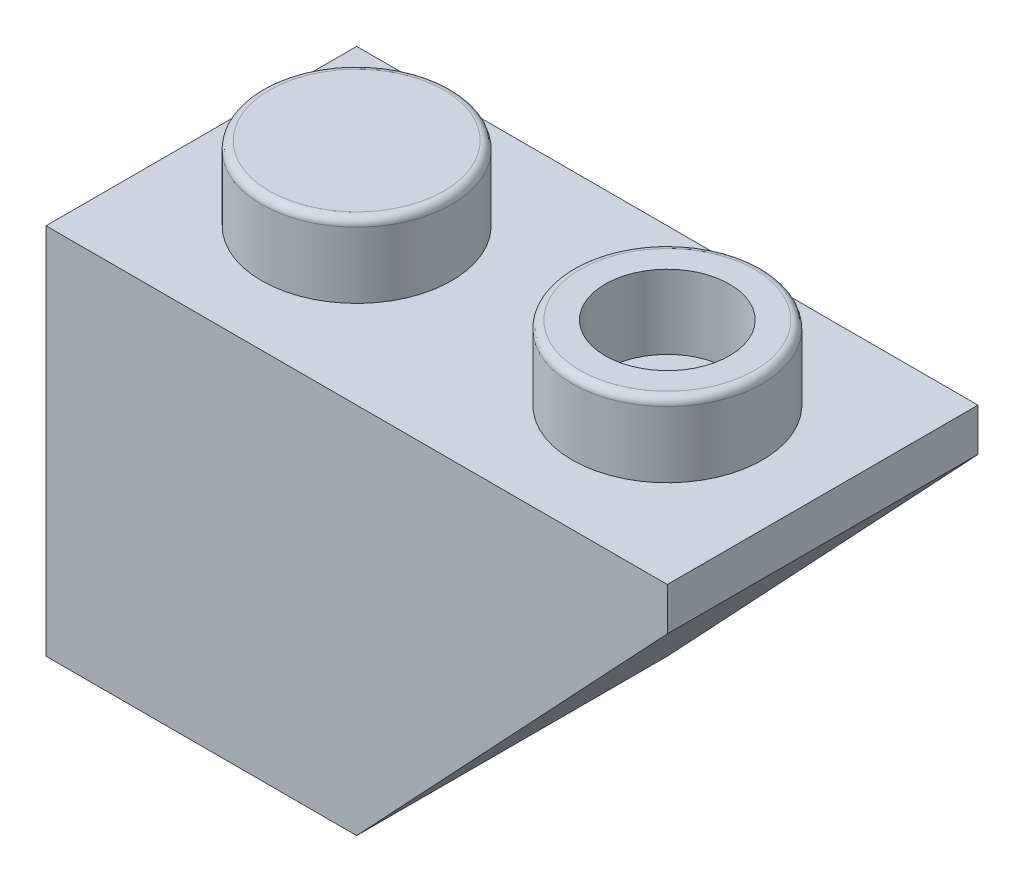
ISO-10303-21;
HEADER;
FILE_DESCRIPTION(('STEP AP214'),'2;1');
FILE_NAME('part.step','',(''),(''),'','','');
FILE_SCHEMA(('AUTOMOTIVE_DESIGN { 1 0 10303 214 1 1 1 1 }'));
ENDSEC;
DATA;
#1=APPLICATION_CONTEXT('core data for automotive mechanical design processes');
#2=APPLICATION_PROTOCOL_DEFINITION('international standard','automotive_design',2000,#1);
#3=PRODUCT_CONTEXT('',#1,'mechanical');
#4=PRODUCT('Part','Part','',(#3));
#5=PRODUCT_RELATED_PRODUCT_CATEGORY('part','',(#4));
#6=PRODUCT_DEFINITION_FORMATION('','',#4);
#7=PRODUCT_DEFINITION_CONTEXT('part definition',#1,'design');
#8=PRODUCT_DEFINITION('design','',#6,#7);
#9=PRODUCT_DEFINITION_SHAPE('','',#8);
#10=(LENGTH_UNIT() NAMED_UNIT(*) SI_UNIT(.MILLI.,.METRE.));
#11=(NAMED_UNIT(*) PLANE_ANGLE_UNIT() SI_UNIT($,.RADIAN.));
#12=(NAMED_UNIT(*) SI_UNIT($,.STERADIAN.) SOLID_ANGLE_UNIT());
#13=UNCERTAINTY_MEASURE_WITH_UNIT(LENGTH_MEASURE(1.E-05),#10,'distance_accuracy_value','');
#14=(GEOMETRIC_REPRESENTATION_CONTEXT(3) GLOBAL_UNCERTAINTY_ASSIGNED_CONTEXT((#13)) GLOBAL_UNIT_ASSIGNED_CONTEXT((#10,
#11,#12)) REPRESENTATION_CONTEXT('',''));
#15=CARTESIAN_POINT('',(0.,0.,0.));
#16=DIRECTION('',(0.,0.,1.));
#17=DIRECTION('',(1.,0.,0.));
#18=AXIS2_PLACEMENT_3D('',#15,#16,#17);
#19=CARTESIAN_POINT('',(7.4,8.6,7.4));
#20=DIRECTION('',(1.,0.,0.));
#21=DIRECTION('',(0.,0.,-1.));
#22=AXIS2_PLACEMENT_3D('',#19,#20,#21);
#23=PLANE('',#22);
#24=DIRECTION('',(0.,1.,0.));
#25=VECTOR('',#24,1.);
#26=CARTESIAN_POINT('',(7.4,0.400000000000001,4.5));
#27=LINE('',#26,#25);
#28=CARTESIAN_POINT('',(7.4,0.400000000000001,4.5));
#29=VERTEX_POINT('',#28);
#30=CARTESIAN_POINT('',(7.4,8.6,4.5));
#31=VERTEX_POINT('',#30);
#32=EDGE_CURVE('E121',#29,#31,#27,.T.);
#33=ORIENTED_EDGE('',*,*,#32,.F.);
#34=DIRECTION('',(0.,0.,1.));
#35=VECTOR('',#34,1.);
#36=CARTESIAN_POINT('',(7.4,0.400000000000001,4.5));
#37=LINE('',#36,#35);
#38=CARTESIAN_POINT('',(7.4,0.400000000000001,3.5));
#39=VERTEX_POINT('',#38);
#40=EDGE_CURVE('E385',#39,#29,#37,.T.);
#41=ORIENTED_EDGE('',*,*,#40,.F.);
#42=DIRECTION('',(0.,1.,0.));
#43=VECTOR('',#42,1.);
#44=CARTESIAN_POINT('',(7.4,0.400000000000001,3.5));
#45=LINE('',#44,#43);
#46=CARTESIAN_POINT('',(7.4,8.6,3.5));
#47=VERTEX_POINT('',#46);
#48=EDGE_CURVE('E383',#39,#47,#45,.T.);
#49=ORIENTED_EDGE('',*,*,#48,.T.);
#50=DIRECTION('',(0.,0.,1.));
#51=VECTOR('',#50,1.);
#52=CARTESIAN_POINT('',(7.4,8.6,7.4));
#53=LINE('',#52,#51);
#54=CARTESIAN_POINT('',(7.4,8.6,0.6));
#55=VERTEX_POINT('',#54);
#56=EDGE_CURVE('E147',#55,#47,#53,.T.);
#57=ORIENTED_EDGE('',*,*,#56,.F.);
#58=DIRECTION('',(0.,-1.,0.));
#59=VECTOR('',#58,1.);
#60=CARTESIAN_POINT('',(7.4,8.6,0.6));
#61=LINE('',#60,#59);
#62=CARTESIAN_POINT('',(7.4,0.,0.6));
#63=VERTEX_POINT('',#62);
#64=EDGE_CURVE('E163',#55,#63,#61,.T.);
#65=ORIENTED_EDGE('',*,*,#64,.T.);
#66=DIRECTION('',(0.,0.,1.));
#67=VECTOR('',#66,1.);
#68=CARTESIAN_POINT('',(7.4,0.,7.4));
#69=LINE('',#68,#67);
#70=CARTESIAN_POINT('',(7.4,0.,7.4));
#71=VERTEX_POINT('',#70);
#72=EDGE_CURVE('E368',#63,#71,#69,.T.);
#73=ORIENTED_EDGE('',*,*,#72,.T.);
#74=DIRECTION('',(0.,-1.,0.));
#75=VECTOR('',#74,1.);
#76=CARTESIAN_POINT('',(7.4,8.6,7.4));
#77=LINE('',#76,#75);
#78=CARTESIAN_POINT('',(7.4,8.6,7.4));
#79=VERTEX_POINT('',#78);
#80=EDGE_CURVE('E145',#79,#71,#77,.T.);
#81=ORIENTED_EDGE('',*,*,#80,.F.);
#82=EDGE_CURVE('E139',#31,#79,#53,.T.);
#83=ORIENTED_EDGE('',*,*,#82,.F.);
#84=EDGE_LOOP('',(#33,#41,#49,#57,#65,#73,#81,#83));
#85=FACE_BOUND('',#84,.T.);
#86=ADVANCED_FACE('F26',(#85),#23,.F.);
#87=CARTESIAN_POINT('',(0.600000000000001,8.6,0.6));
#88=DIRECTION('',(0.,-1.,0.));
#89=DIRECTION('',(0.,0.,-1.));
#90=AXIS2_PLACEMENT_3D('',#87,#88,#89);
#91=PLANE('',#90);
#92=CARTESIAN_POINT('',(4.,8.6,4.));
#93=DIRECTION('',(0.,-1.,0.));
#94=DIRECTION('',(0.,0.,-1.));
#95=AXIS2_PLACEMENT_3D('',#92,#93,#94);
#96=CIRCLE('',#95,1.25);
#97=CARTESIAN_POINT('',(4.,8.6,2.75));
#98=VERTEX_POINT('',#97);
#99=EDGE_CURVE('E374',#98,#98,#96,.T.);
#100=ORIENTED_EDGE('',*,*,#99,.F.);
#101=EDGE_LOOP('',(#100));
#102=FACE_BOUND('',#101,.T.);
#103=DIRECTION('',(0.,0.,-1.));
#104=VECTOR('',#103,1.);
#105=CARTESIAN_POINT('',(6.9,8.6,4.5));
#106=LINE('',#105,#104);
#107=CARTESIAN_POINT('',(6.9,8.6,4.5));
#108=VERTEX_POINT('',#107);
#109=CARTESIAN_POINT('',(6.9,8.6,3.5));
#110=VERTEX_POINT('',#109);
#111=EDGE_CURVE('E142',#108,#110,#106,.T.);
#112=ORIENTED_EDGE('',*,*,#111,.F.);
#113=DIRECTION('',(-1.,0.,0.));
#114=VECTOR('',#113,1.);
#115=CARTESIAN_POINT('',(7.4,8.6,4.5));
#116=LINE('',#115,#114);
#117=EDGE_CURVE('E125',#31,#108,#116,.T.);
#118=ORIENTED_EDGE('',*,*,#117,.F.);
#119=ORIENTED_EDGE('',*,*,#82,.T.);
#120=DIRECTION('',(-1.,0.,0.));
#121=VECTOR('',#120,1.);
#122=CARTESIAN_POINT('',(0.6,8.6,7.4));
#123=LINE('',#122,#121);
#124=CARTESIAN_POINT('',(0.6,8.6,7.4));
#125=VERTEX_POINT('',#124);
#126=EDGE_CURVE('E151',#79,#125,#123,.T.);
#127=ORIENTED_EDGE('',*,*,#126,.T.);
#128=DIRECTION('',(0.,0.,-1.));
#129=VECTOR('',#128,1.);
#130=CARTESIAN_POINT('',(0.6,8.6,7.4));
#131=LINE('',#130,#129);
#132=CARTESIAN_POINT('',(0.600000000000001,8.6,0.6));
#133=VERTEX_POINT('',#132);
#134=EDGE_CURVE('E153',#125,#133,#131,.T.);
#135=ORIENTED_EDGE('',*,*,#134,.T.);
#136=DIRECTION('',(1.,0.,0.));
#137=VECTOR('',#136,1.);
#138=CARTESIAN_POINT('',(0.600000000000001,8.6,0.6));
#139=LINE('',#138,#137);
#140=EDGE_CURVE('E148',#133,#55,#139,.T.);
#141=ORIENTED_EDGE('',*,*,#140,.T.);
#142=ORIENTED_EDGE('',*,*,#56,.T.);
#143=DIRECTION('',(1.,0.,0.));
#144=VECTOR('',#143,1.);
#145=CARTESIAN_POINT('',(7.4,8.6,3.5));
#146=LINE('',#145,#144);
#147=EDGE_CURVE('E384',#110,#47,#146,.T.);
#148=ORIENTED_EDGE('',*,*,#147,.F.);
#149=EDGE_LOOP('',(#112,#118,#119,#127,#135,#141,#142,#148));
#150=FACE_BOUND('',#149,.T.);
#151=ADVANCED_FACE('F137',(#102,#150),#91,.T.);
#152=CARTESIAN_POINT('',(0.,9.6,8.));
#153=DIRECTION('',(0.,-1.,0.));
#154=DIRECTION('',(0.,0.,-1.));
#155=AXIS2_PLACEMENT_3D('',#152,#153,#154);
#156=PLANE('',#155);
#157=CARTESIAN_POINT('',(12.,9.6,4.));
#158=DIRECTION('',(0.,-1.,0.));
#159=DIRECTION('',(0.,0.,-1.));
#160=AXIS2_PLACEMENT_3D('',#157,#158,#159);
#161=CIRCLE('',#160,2.45);
#162=CARTESIAN_POINT('',(12.,9.6,1.55));
#163=VERTEX_POINT('',#162);
#164=EDGE_CURVE('E204',#163,#163,#161,.F.);
#165=ORIENTED_EDGE('',*,*,#164,.F.);
#166=EDGE_LOOP('',(#165));
#167=FACE_BOUND('',#166,.T.);
#168=DIRECTION('',(-1.,0.,0.));
#169=VECTOR('',#168,1.);
#170=CARTESIAN_POINT('',(0.,9.6,0.));
#171=LINE('',#170,#169);
#172=CARTESIAN_POINT('',(16.,9.6,0.));
#173=VERTEX_POINT('',#172);
#174=CARTESIAN_POINT('',(0.,9.6,0.));
#175=VERTEX_POINT('',#174);
#176=EDGE_CURVE('E183',#173,#175,#171,.T.);
#177=ORIENTED_EDGE('',*,*,#176,.T.);
#178=DIRECTION('',(0.,0.,-1.));
#179=VECTOR('',#178,1.);
#180=CARTESIAN_POINT('',(0.,9.6,8.));
#181=LINE('',#180,#179);
#182=CARTESIAN_POINT('',(0.,9.6,8.));
#183=VERTEX_POINT('',#182);
#184=EDGE_CURVE('E195',#183,#175,#181,.T.);
#185=ORIENTED_EDGE('',*,*,#184,.F.);
#186=DIRECTION('',(-1.,0.,0.));
#187=VECTOR('',#186,1.);
#188=CARTESIAN_POINT('',(0.,9.6,8.));
#189=LINE('',#188,#187);
#190=CARTESIAN_POINT('',(16.,9.6,8.));
#191=VERTEX_POINT('',#190);
#192=EDGE_CURVE('E193',#191,#183,#189,.T.);
#193=ORIENTED_EDGE('',*,*,#192,.F.);
#194=DIRECTION('',(0.,0.,-1.));
#195=VECTOR('',#194,1.);
#196=CARTESIAN_POINT('',(16.,9.6,8.));
#197=LINE('',#196,#195);
#198=EDGE_CURVE('E198',#191,#173,#197,.T.);
#199=ORIENTED_EDGE('',*,*,#198,.T.);
#200=EDGE_LOOP('',(#177,#185,#193,#199));
#201=FACE_BOUND('',#200,.T.);
#202=CARTESIAN_POINT('',(4.,9.6,4.));
#203=DIRECTION('',(0.,-1.,0.));
#204=DIRECTION('',(0.,0.,-1.));
#205=AXIS2_PLACEMENT_3D('',#202,#203,#204);
#206=CIRCLE('',#205,2.45);
#207=CARTESIAN_POINT('',(4.,9.6,1.55));
#208=VERTEX_POINT('',#207);
#209=EDGE_CURVE('E207',#208,#208,#206,.F.);
#210=ORIENTED_EDGE('',*,*,#209,.F.);
#211=EDGE_LOOP('',(#210));
#212=FACE_BOUND('',#211,.T.);
#213=ADVANCED_FACE('F243',(#167,#201,#212),#156,.F.);
#214=CARTESIAN_POINT('',(0.,0.,8.));
#215=DIRECTION('',(1.,0.,0.));
#216=DIRECTION('',(0.,1.,0.));
#217=AXIS2_PLACEMENT_3D('',#214,#215,#216);
#218=PLANE('',#217);
#219=DIRECTION('',(0.,-1.,0.));
#220=VECTOR('',#219,1.);
#221=CARTESIAN_POINT('',(0.,0.,0.));
#222=LINE('',#221,#220);
#223=CARTESIAN_POINT('',(0.,0.,0.));
#224=VERTEX_POINT('',#223);
#225=EDGE_CURVE('E174',#175,#224,#222,.T.);
#226=ORIENTED_EDGE('',*,*,#225,.T.);
#227=DIRECTION('',(0.,0.,-1.));
#228=VECTOR('',#227,1.);
#229=CARTESIAN_POINT('',(0.,0.,8.));
#230=LINE('',#229,#228);
#231=CARTESIAN_POINT('',(0.,0.,8.));
#232=VERTEX_POINT('',#231);
#233=EDGE_CURVE('E201',#232,#224,#230,.T.);
#234=ORIENTED_EDGE('',*,*,#233,.F.);
#235=DIRECTION('',(0.,-1.,0.));
#236=VECTOR('',#235,1.);
#237=CARTESIAN_POINT('',(0.,0.,8.));
#238=LINE('',#237,#236);
#239=EDGE_CURVE('E185',#183,#232,#238,.T.);
#240=ORIENTED_EDGE('',*,*,#239,.F.);
#241=ORIENTED_EDGE('',*,*,#184,.T.);
#242=EDGE_LOOP('',(#226,#234,#240,#241));
#243=FACE_BOUND('',#242,.T.);
#244=ADVANCED_FACE('F28',(#243),#218,.F.);
#245=CARTESIAN_POINT('',(0.,0.,8.));
#246=DIRECTION('',(0.,1.,0.));
#247=DIRECTION('',(0.,0.,1.));
#248=AXIS2_PLACEMENT_3D('',#245,#246,#247);
#249=PLANE('',#248);
#250=DIRECTION('',(1.,0.,0.));
#251=VECTOR('',#250,1.);
#252=CARTESIAN_POINT('',(0.600000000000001,0.,0.6));
#253=LINE('',#252,#251);
#254=CARTESIAN_POINT('',(0.600000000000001,0.,0.6));
#255=VERTEX_POINT('',#254);
#256=EDGE_CURVE('E286',#255,#63,#253,.T.);
#257=ORIENTED_EDGE('',*,*,#256,.F.);
#258=DIRECTION('',(0.,0.,-1.));
#259=VECTOR('',#258,1.);
#260=CARTESIAN_POINT('',(0.6,0.,7.4));
#261=LINE('',#260,#259);
#262=CARTESIAN_POINT('',(0.6,0.,7.4));
#263=VERTEX_POINT('',#262);
#264=EDGE_CURVE('E49',#263,#255,#261,.T.);
#265=ORIENTED_EDGE('',*,*,#264,.F.);
#266=DIRECTION('',(-1.,0.,0.));
#267=VECTOR('',#266,1.);
#268=CARTESIAN_POINT('',(0.6,0.,7.4));
#269=LINE('',#268,#267);
#270=EDGE_CURVE('E366',#71,#263,#269,.T.);
#271=ORIENTED_EDGE('',*,*,#270,.F.);
#272=ORIENTED_EDGE('',*,*,#72,.F.);
#273=EDGE_LOOP('',(#257,#265,#271,#272));
#274=FACE_BOUND('',#273,.T.);
#275=DIRECTION('',(1.,0.,0.));
#276=VECTOR('',#275,1.);
#277=CARTESIAN_POINT('',(0.,0.,0.));
#278=LINE('',#277,#276);
#279=CARTESIAN_POINT('',(8.,0.,0.));
#280=VERTEX_POINT('',#279);
#281=EDGE_CURVE('E178',#224,#280,#278,.T.);
#282=ORIENTED_EDGE('',*,*,#281,.T.);
#283=DIRECTION('',(0.,0.,1.));
#284=VECTOR('',#283,1.);
#285=CARTESIAN_POINT('',(8.,0.,0.));
#286=LINE('',#285,#284);
#287=CARTESIAN_POINT('',(8.,0.,8.));
#288=VERTEX_POINT('',#287);
#289=EDGE_CURVE('E171',#280,#288,#286,.T.);
#290=ORIENTED_EDGE('',*,*,#289,.T.);
#291=DIRECTION('',(1.,0.,0.));
#292=VECTOR('',#291,1.);
#293=CARTESIAN_POINT('',(0.,0.,8.));
#294=LINE('',#293,#292);
#295=EDGE_CURVE('E188',#232,#288,#294,.T.);
#296=ORIENTED_EDGE('',*,*,#295,.F.);
#297=ORIENTED_EDGE('',*,*,#233,.T.);
#298=EDGE_LOOP('',(#282,#290,#296,#297));
#299=FACE_BOUND('',#298,.T.);
#300=ADVANCED_FACE('F274',(#274,#299),#249,.F.);
#301=CARTESIAN_POINT('',(16.,0.,8.));
#302=DIRECTION('',(-1.,0.,0.));
#303=DIRECTION('',(0.,-1.,0.));
#304=AXIS2_PLACEMENT_3D('',#301,#302,#303);
#305=PLANE('',#304);
#306=DIRECTION('',(0.,1.,0.));
#307=VECTOR('',#306,1.);
#308=CARTESIAN_POINT('',(16.,0.,8.));
#309=LINE('',#308,#307);
#310=CARTESIAN_POINT('',(16.,8.5,8.));
#311=VERTEX_POINT('',#310);
#312=EDGE_CURVE('E191',#311,#191,#309,.T.);
#313=ORIENTED_EDGE('',*,*,#312,.F.);
#314=DIRECTION('',(0.,0.,1.));
#315=VECTOR('',#314,1.);
#316=CARTESIAN_POINT('',(16.,8.5,0.));
#317=LINE('',#316,#315);
#318=CARTESIAN_POINT('',(16.,8.5,0.));
#319=VERTEX_POINT('',#318);
#320=EDGE_CURVE('E170',#319,#311,#317,.T.);
#321=ORIENTED_EDGE('',*,*,#320,.F.);
#322=DIRECTION('',(0.,1.,0.));
#323=VECTOR('',#322,1.);
#324=CARTESIAN_POINT('',(16.,0.,0.));
#325=LINE('',#324,#323);
#326=EDGE_CURVE('E181',#319,#173,#325,.T.);
#327=ORIENTED_EDGE('',*,*,#326,.T.);
#328=ORIENTED_EDGE('',*,*,#198,.F.);
#329=EDGE_LOOP('',(#313,#321,#327,#328));
#330=FACE_BOUND('',#329,.T.);
#331=ADVANCED_FACE('F268',(#330),#305,.F.);
#332=CARTESIAN_POINT('',(0.,9.6,8.));
#333=DIRECTION('',(0.,0.,-1.));
#334=DIRECTION('',(-1.,0.,0.));
#335=AXIS2_PLACEMENT_3D('',#332,#333,#334);
#336=PLANE('',#335);
#337=ORIENTED_EDGE('',*,*,#295,.T.);
#338=DIRECTION('',(-0.685364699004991,-0.728199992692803,0.));
#339=VECTOR('',#338,1.);
#340=CARTESIAN_POINT('',(16.,8.5,8.));
#341=LINE('',#340,#339);
#342=EDGE_CURVE('E161',#311,#288,#341,.T.);
#343=ORIENTED_EDGE('',*,*,#342,.F.);
#344=ORIENTED_EDGE('',*,*,#312,.T.);
#345=ORIENTED_EDGE('',*,*,#192,.T.);
#346=ORIENTED_EDGE('',*,*,#239,.T.);
#347=EDGE_LOOP('',(#337,#343,#344,#345,#346));
#348=FACE_BOUND('',#347,.T.);
#349=ADVANCED_FACE('F264',(#348),#336,.F.);
#350=CARTESIAN_POINT('',(0.,9.6,0.));
#351=DIRECTION('',(0.,0.,-1.));
#352=DIRECTION('',(-1.,0.,0.));
#353=AXIS2_PLACEMENT_3D('',#350,#351,#352);
#354=PLANE('',#353);
#355=DIRECTION('',(-0.685364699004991,-0.728199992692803,0.));
#356=VECTOR('',#355,1.);
#357=CARTESIAN_POINT('',(16.,8.5,0.));
#358=LINE('',#357,#356);
#359=EDGE_CURVE('E167',#319,#280,#358,.T.);
#360=ORIENTED_EDGE('',*,*,#359,.T.);
#361=ORIENTED_EDGE('',*,*,#281,.F.);
#362=ORIENTED_EDGE('',*,*,#225,.F.);
#363=ORIENTED_EDGE('',*,*,#176,.F.);
#364=ORIENTED_EDGE('',*,*,#326,.F.);
#365=EDGE_LOOP('',(#360,#361,#362,#363,#364));
#366=FACE_BOUND('',#365,.T.);
#367=ADVANCED_FACE('F260',(#366),#354,.T.);
#368=CARTESIAN_POINT('',(16.,8.5,0.));
#369=DIRECTION('',(-0.728199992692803,0.685364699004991,0.));
#370=DIRECTION('',(-0.685364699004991,-0.728199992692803,0.));
#371=AXIS2_PLACEMENT_3D('',#368,#369,#370);
#372=PLANE('',#371);
#373=ORIENTED_EDGE('',*,*,#342,.T.);
#374=ORIENTED_EDGE('',*,*,#289,.F.);
#375=ORIENTED_EDGE('',*,*,#359,.F.);
#376=ORIENTED_EDGE('',*,*,#320,.T.);
#377=EDGE_LOOP('',(#373,#374,#375,#376));
#378=FACE_BOUND('',#377,.T.);
#379=ADVANCED_FACE('F257',(#378),#372,.F.);
#380=CARTESIAN_POINT('',(0.6,8.6,7.4));
#381=DIRECTION('',(-1.,0.,0.));
#382=DIRECTION('',(0.,0.,1.));
#383=AXIS2_PLACEMENT_3D('',#380,#381,#382);
#384=PLANE('',#383);
#385=ORIENTED_EDGE('',*,*,#264,.T.);
#386=DIRECTION('',(0.,-1.,0.));
#387=VECTOR('',#386,1.);
#388=CARTESIAN_POINT('',(0.600000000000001,8.6,0.6));
#389=LINE('',#388,#387);
#390=EDGE_CURVE('E158',#133,#255,#389,.T.);
#391=ORIENTED_EDGE('',*,*,#390,.F.);
#392=ORIENTED_EDGE('',*,*,#134,.F.);
#393=DIRECTION('',(0.,-1.,0.));
#394=VECTOR('',#393,1.);
#395=CARTESIAN_POINT('',(0.6,8.6,7.4));
#396=LINE('',#395,#394);
#397=EDGE_CURVE('E159',#125,#263,#396,.T.);
#398=ORIENTED_EDGE('',*,*,#397,.T.);
#399=EDGE_LOOP('',(#385,#391,#392,#398));
#400=FACE_BOUND('',#399,.T.);
#401=ADVANCED_FACE('F254',(#400),#384,.F.);
#402=CARTESIAN_POINT('',(0.6,8.6,7.4));
#403=DIRECTION('',(0.,0.,1.));
#404=DIRECTION('',(1.,0.,0.));
#405=AXIS2_PLACEMENT_3D('',#402,#403,#404);
#406=PLANE('',#405);
#407=ORIENTED_EDGE('',*,*,#270,.T.);
#408=ORIENTED_EDGE('',*,*,#397,.F.);
#409=ORIENTED_EDGE('',*,*,#126,.F.);
#410=ORIENTED_EDGE('',*,*,#80,.T.);
#411=EDGE_LOOP('',(#407,#408,#409,#410));
#412=FACE_BOUND('',#411,.T.);
#413=ADVANCED_FACE('F248',(#412),#406,.F.);
#414=CARTESIAN_POINT('',(0.600000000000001,8.6,0.6));
#415=DIRECTION('',(0.,0.,-1.));
#416=DIRECTION('',(-1.,0.,0.));
#417=AXIS2_PLACEMENT_3D('',#414,#415,#416);
#418=PLANE('',#417);
#419=ORIENTED_EDGE('',*,*,#256,.T.);
#420=ORIENTED_EDGE('',*,*,#64,.F.);
#421=ORIENTED_EDGE('',*,*,#140,.F.);
#422=ORIENTED_EDGE('',*,*,#390,.T.);
#423=EDGE_LOOP('',(#419,#420,#421,#422));
#424=FACE_BOUND('',#423,.T.);
#425=ADVANCED_FACE('F249',(#424),#418,.F.);
#426=CARTESIAN_POINT('',(12.,11.5,4.));
#427=DIRECTION('',(0.,-1.,0.));
#428=DIRECTION('',(0.,0.,-1.));
#429=AXIS2_PLACEMENT_3D('',#426,#427,#428);
#430=CYLINDRICAL_SURFACE('',#429,2.45);
#431=CARTESIAN_POINT('',(12.,11.3,4.));
#432=DIRECTION('',(0.,1.,0.));
#433=DIRECTION('',(0.,0.,1.));
#434=AXIS2_PLACEMENT_3D('',#431,#432,#433);
#435=CIRCLE('',#434,2.45);
#436=CARTESIAN_POINT('',(12.,11.3,1.55));
#437=VERTEX_POINT('',#436);
#438=EDGE_CURVE('E11',#437,#437,#435,.F.);
#439=CARTESIAN_POINT('',(12.,11.3,1.55));
#440=CARTESIAN_POINT('',(12.,11.2822916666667,1.55));
#441=CARTESIAN_POINT('',(12.,11.2645833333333,1.55));
#442=CARTESIAN_POINT('',(12.,11.2291666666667,1.55));
#443=CARTESIAN_POINT('',(12.,11.2114583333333,1.55));
#444=CARTESIAN_POINT('',(12.,11.1760416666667,1.55));
#445=CARTESIAN_POINT('',(12.,11.1583333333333,1.55));
#446=CARTESIAN_POINT('',(12.,11.1229166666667,1.55));
#447=CARTESIAN_POINT('',(12.,11.1052083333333,1.55));
#448=CARTESIAN_POINT('',(12.,11.0697916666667,1.55));
#449=CARTESIAN_POINT('',(12.,11.0520833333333,1.55));
#450=CARTESIAN_POINT('',(12.,11.0166666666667,1.55));
#451=CARTESIAN_POINT('',(12.,10.9989583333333,1.55));
#452=CARTESIAN_POINT('',(12.,10.9635416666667,1.55));
#453=CARTESIAN_POINT('',(12.,10.9458333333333,1.55));
#454=CARTESIAN_POINT('',(12.,10.9104166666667,1.55));
#455=CARTESIAN_POINT('',(12.,10.8927083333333,1.55));
#456=CARTESIAN_POINT('',(12.,10.8572916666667,1.55));
#457=CARTESIAN_POINT('',(12.,10.8395833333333,1.55));
#458=CARTESIAN_POINT('',(12.,10.8041666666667,1.55));
#459=CARTESIAN_POINT('',(12.,10.7864583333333,1.55));
#460=CARTESIAN_POINT('',(12.,10.7510416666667,1.55));
#461=CARTESIAN_POINT('',(12.,10.7333333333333,1.55));
#462=CARTESIAN_POINT('',(12.,10.6979166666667,1.55));
#463=CARTESIAN_POINT('',(12.,10.6802083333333,1.55));
#464=CARTESIAN_POINT('',(12.,10.6447916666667,1.55));
#465=CARTESIAN_POINT('',(12.,10.6270833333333,1.55));
#466=CARTESIAN_POINT('',(12.,10.5916666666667,1.55));
#467=CARTESIAN_POINT('',(12.,10.5739583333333,1.55));
#468=CARTESIAN_POINT('',(12.,10.5385416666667,1.55));
#469=CARTESIAN_POINT('',(12.,10.5208333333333,1.55));
#470=CARTESIAN_POINT('',(12.,10.4854166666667,1.55));
#471=CARTESIAN_POINT('',(12.,10.4677083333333,1.55));
#472=CARTESIAN_POINT('',(12.,10.4322916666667,1.55));
#473=CARTESIAN_POINT('',(12.,10.4145833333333,1.55));
#474=CARTESIAN_POINT('',(12.,10.3791666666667,1.55));
#475=CARTESIAN_POINT('',(12.,10.3614583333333,1.55));
#476=CARTESIAN_POINT('',(12.,10.3260416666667,1.55));
#477=CARTESIAN_POINT('',(12.,10.3083333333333,1.55));
#478=CARTESIAN_POINT('',(12.,10.2729166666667,1.55));
#479=CARTESIAN_POINT('',(12.,10.2552083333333,1.55));
#480=CARTESIAN_POINT('',(12.,10.2197916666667,1.55));
#481=CARTESIAN_POINT('',(12.,10.2020833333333,1.55));
#482=CARTESIAN_POINT('',(12.,10.1666666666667,1.55));
#483=CARTESIAN_POINT('',(12.,10.1489583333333,1.55));
#484=CARTESIAN_POINT('',(12.,10.1135416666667,1.55));
#485=CARTESIAN_POINT('',(12.,10.0958333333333,1.55));
#486=CARTESIAN_POINT('',(12.,10.0604166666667,1.55));
#487=CARTESIAN_POINT('',(12.,10.0427083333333,1.55));
#488=CARTESIAN_POINT('',(12.,10.0072916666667,1.55));
#489=CARTESIAN_POINT('',(12.,9.98958333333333,1.55));
#490=CARTESIAN_POINT('',(12.,9.95416666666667,1.55));
#491=CARTESIAN_POINT('',(12.,9.93645833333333,1.55));
#492=CARTESIAN_POINT('',(12.,9.90104166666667,1.55));
#493=CARTESIAN_POINT('',(12.,9.88333333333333,1.55));
#494=CARTESIAN_POINT('',(12.,9.84791666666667,1.55));
#495=CARTESIAN_POINT('',(12.,9.83020833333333,1.55));
#496=CARTESIAN_POINT('',(12.,9.79479166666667,1.55));
#497=CARTESIAN_POINT('',(12.,9.77708333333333,1.55));
#498=CARTESIAN_POINT('',(12.,9.74166666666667,1.55));
#499=CARTESIAN_POINT('',(12.,9.72395833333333,1.55));
#500=CARTESIAN_POINT('',(12.,9.68854166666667,1.55));
#501=CARTESIAN_POINT('',(12.,9.67083333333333,1.55));
#502=CARTESIAN_POINT('',(12.,9.63541666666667,1.55));
#503=CARTESIAN_POINT('',(12.,9.61770833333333,1.55));
#504=CARTESIAN_POINT('',(12.,9.6,1.55));
#505=B_SPLINE_CURVE_WITH_KNOTS('',3,(#439,#440,#441,#442,#443,#444,#445,#446,#447,#448,#449,
#450,#451,#452,#453,#454,#455,#456,#457,#458,#459,#460,#461,#462,#463,#464,#465,#466,#467,#468,
#469,#470,#471,#472,#473,#474,#475,#476,#477,#478,#479,#480,#481,#482,#483,#484,#485,#486,#487,
#488,#489,#490,#491,#492,#493,#494,#495,#496,#497,#498,#499,#500,#501,#502,#503,#504),
.UNSPECIFIED.,.F.,.F.,(4,2,2,2,2,2,2,2,2,2,2,2,2,2,2,2,2,2,2,2,2,2,2,2,2,2,2,2,2,2,2,2,4),(0.,
0.0531250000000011,0.10625,0.159375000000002,0.212500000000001,0.265625,0.318750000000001,
0.371875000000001,0.425,0.478125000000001,0.53125,0.584375,0.637500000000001,0.690625,0.74375,
0.796875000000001,0.85,0.903124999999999,0.95625,1.009375,1.0625,1.115625,1.16875,1.221875,
1.275,1.328125,1.38125,1.434375,1.4875,1.540625,1.59375,1.646875,1.7),.UNSPECIFIED.);
#506=EDGE_CURVE('BSEAM252',#437,#163,#505,.T.);
#507=ORIENTED_EDGE('',*,*,#438,.T.);
#508=ORIENTED_EDGE('',*,*,#164,.T.);
#509=ORIENTED_EDGE('',*,*,#506,.T.);
#510=ORIENTED_EDGE('',*,*,#506,.F.);
#511=EDGE_LOOP('',(#507,#509,#508,#510));
#512=FACE_BOUND('',#511,.T.);
#513=ADVANCED_FACE('F252',(#512),#430,.T.);
#514=CARTESIAN_POINT('',(12.,11.5,4.));
#515=DIRECTION('',(0.,1.,0.));
#516=DIRECTION('',(0.,0.,1.));
#517=AXIS2_PLACEMENT_3D('',#514,#515,#516);
#518=PLANE('',#517);
#519=CARTESIAN_POINT('',(12.,11.5,4.));
#520=DIRECTION('',(0.,1.,0.));
#521=DIRECTION('',(0.,0.,1.));
#522=AXIS2_PLACEMENT_3D('',#519,#520,#521);
#523=CIRCLE('',#522,1.6);
#524=CARTESIAN_POINT('',(12.,11.5,5.6));
#525=VERTEX_POINT('',#524);
#526=EDGE_CURVE('E132',#525,#525,#523,.T.);
#527=ORIENTED_EDGE('',*,*,#526,.F.);
#528=EDGE_LOOP('',(#527));
#529=FACE_BOUND('',#528,.T.);
#530=CARTESIAN_POINT('',(12.,11.5,4.));
#531=DIRECTION('',(0.,1.,0.));
#532=DIRECTION('',(0.,0.,1.));
#533=AXIS2_PLACEMENT_3D('',#530,#531,#532);
#534=CIRCLE('',#533,2.25);
#535=CARTESIAN_POINT('',(12.,11.5,6.25));
#536=VERTEX_POINT('',#535);
#537=EDGE_CURVE('E34',#536,#536,#534,.T.);
#538=ORIENTED_EDGE('',*,*,#537,.T.);
#539=EDGE_LOOP('',(#538));
#540=FACE_BOUND('',#539,.T.);
#541=ADVANCED_FACE('F218',(#529,#540),#518,.T.);
#542=CARTESIAN_POINT('',(4.,11.5,4.));
#543=DIRECTION('',(0.,-1.,0.));
#544=DIRECTION('',(0.,0.,-1.));
#545=AXIS2_PLACEMENT_3D('',#542,#543,#544);
#546=CYLINDRICAL_SURFACE('',#545,2.45);
#547=CARTESIAN_POINT('',(4.,11.3,4.));
#548=DIRECTION('',(0.,1.,0.));
#549=DIRECTION('',(0.,0.,1.));
#550=AXIS2_PLACEMENT_3D('',#547,#548,#549);
#551=CIRCLE('',#550,2.45);
#552=CARTESIAN_POINT('',(4.,11.3,1.55));
#553=VERTEX_POINT('',#552);
#554=EDGE_CURVE('E213',#553,#553,#551,.F.);
#555=CARTESIAN_POINT('',(4.,11.3,1.55));
#556=CARTESIAN_POINT('',(4.,11.2822916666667,1.55));
#557=CARTESIAN_POINT('',(4.,11.2645833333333,1.55));
#558=CARTESIAN_POINT('',(4.,11.2291666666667,1.55));
#559=CARTESIAN_POINT('',(4.,11.2114583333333,1.55));
#560=CARTESIAN_POINT('',(4.,11.1760416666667,1.55));
#561=CARTESIAN_POINT('',(4.,11.1583333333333,1.55));
#562=CARTESIAN_POINT('',(4.,11.1229166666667,1.55));
#563=CARTESIAN_POINT('',(4.,11.1052083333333,1.55));
#564=CARTESIAN_POINT('',(4.,11.0697916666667,1.55));
#565=CARTESIAN_POINT('',(4.,11.0520833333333,1.55));
#566=CARTESIAN_POINT('',(4.,11.0166666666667,1.55));
#567=CARTESIAN_POINT('',(4.,10.9989583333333,1.55));
#568=CARTESIAN_POINT('',(4.,10.9635416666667,1.55));
#569=CARTESIAN_POINT('',(4.,10.9458333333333,1.55));
#570=CARTESIAN_POINT('',(4.,10.9104166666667,1.55));
#571=CARTESIAN_POINT('',(4.,10.8927083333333,1.55));
#572=CARTESIAN_POINT('',(4.,10.8572916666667,1.55));
#573=CARTESIAN_POINT('',(4.,10.8395833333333,1.55));
#574=CARTESIAN_POINT('',(4.,10.8041666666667,1.55));
#575=CARTESIAN_POINT('',(4.,10.7864583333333,1.55));
#576=CARTESIAN_POINT('',(4.,10.7510416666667,1.55));
#577=CARTESIAN_POINT('',(4.,10.7333333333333,1.55));
#578=CARTESIAN_POINT('',(4.,10.6979166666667,1.55));
#579=CARTESIAN_POINT('',(4.,10.6802083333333,1.55));
#580=CARTESIAN_POINT('',(4.,10.6447916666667,1.55));
#581=CARTESIAN_POINT('',(4.,10.6270833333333,1.55));
#582=CARTESIAN_POINT('',(4.,10.5916666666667,1.55));
#583=CARTESIAN_POINT('',(4.,10.5739583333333,1.55));
#584=CARTESIAN_POINT('',(4.,10.5385416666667,1.55));
#585=CARTESIAN_POINT('',(4.,10.5208333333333,1.55));
#586=CARTESIAN_POINT('',(4.,10.4854166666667,1.55));
#587=CARTESIAN_POINT('',(4.,10.4677083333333,1.55));
#588=CARTESIAN_POINT('',(4.,10.4322916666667,1.55));
#589=CARTESIAN_POINT('',(4.,10.4145833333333,1.55));
#590=CARTESIAN_POINT('',(4.,10.3791666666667,1.55));
#591=CARTESIAN_POINT('',(4.,10.3614583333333,1.55));
#592=CARTESIAN_POINT('',(4.,10.3260416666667,1.55));
#593=CARTESIAN_POINT('',(4.,10.3083333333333,1.55));
#594=CARTESIAN_POINT('',(4.,10.2729166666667,1.55));
#595=CARTESIAN_POINT('',(4.,10.2552083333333,1.55));
#596=CARTESIAN_POINT('',(4.,10.2197916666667,1.55));
#597=CARTESIAN_POINT('',(4.,10.2020833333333,1.55));
#598=CARTESIAN_POINT('',(4.,10.1666666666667,1.55));
#599=CARTESIAN_POINT('',(4.,10.1489583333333,1.55));
#600=CARTESIAN_POINT('',(4.,10.1135416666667,1.55));
#601=CARTESIAN_POINT('',(4.,10.0958333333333,1.55));
#602=CARTESIAN_POINT('',(4.,10.0604166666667,1.55));
#603=CARTESIAN_POINT('',(4.,10.0427083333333,1.55));
#604=CARTESIAN_POINT('',(4.,10.0072916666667,1.55));
#605=CARTESIAN_POINT('',(4.,9.98958333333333,1.55));
#606=CARTESIAN_POINT('',(4.,9.95416666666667,1.55));
#607=CARTESIAN_POINT('',(4.,9.93645833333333,1.55));
#608=CARTESIAN_POINT('',(4.,9.90104166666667,1.55));
#609=CARTESIAN_POINT('',(4.,9.88333333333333,1.55));
#610=CARTESIAN_POINT('',(4.,9.84791666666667,1.55));
#611=CARTESIAN_POINT('',(4.,9.83020833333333,1.55));
#612=CARTESIAN_POINT('',(4.,9.79479166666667,1.55));
#613=CARTESIAN_POINT('',(4.,9.77708333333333,1.55));
#614=CARTESIAN_POINT('',(4.,9.74166666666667,1.55));
#615=CARTESIAN_POINT('',(4.,9.72395833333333,1.55));
#616=CARTESIAN_POINT('',(4.,9.68854166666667,1.55));
#617=CARTESIAN_POINT('',(4.,9.67083333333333,1.55));
#618=CARTESIAN_POINT('',(4.,9.63541666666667,1.55));
#619=CARTESIAN_POINT('',(4.,9.61770833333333,1.55));
#620=CARTESIAN_POINT('',(4.,9.6,1.55));
#621=B_SPLINE_CURVE_WITH_KNOTS('',3,(#555,#556,#557,#558,#559,#560,#561,#562,#563,#564,#565,
#566,#567,#568,#569,#570,#571,#572,#573,#574,#575,#576,#577,#578,#579,#580,#581,#582,#583,#584,
#585,#586,#587,#588,#589,#590,#591,#592,#593,#594,#595,#596,#597,#598,#599,#600,#601,#602,#603,
#604,#605,#606,#607,#608,#609,#610,#611,#612,#613,#614,#615,#616,#617,#618,#619,#620),
.UNSPECIFIED.,.F.,.F.,(4,2,2,2,2,2,2,2,2,2,2,2,2,2,2,2,2,2,2,2,2,2,2,2,2,2,2,2,2,2,2,2,4),(0.,
0.0531250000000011,0.10625,0.159375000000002,0.212500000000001,0.265625,0.318750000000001,
0.371875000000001,0.425,0.478125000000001,0.53125,0.584375,0.637500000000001,0.690625,0.74375,
0.796875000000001,0.85,0.903124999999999,0.95625,1.009375,1.0625,1.115625,1.16875,1.221875,
1.275,1.328125,1.38125,1.434375,1.4875,1.540625,1.59375,1.646875,1.7),.UNSPECIFIED.);
#622=EDGE_CURVE('BSEAM302',#553,#208,#621,.T.);
#623=ORIENTED_EDGE('',*,*,#554,.T.);
#624=ORIENTED_EDGE('',*,*,#209,.T.);
#625=ORIENTED_EDGE('',*,*,#622,.T.);
#626=ORIENTED_EDGE('',*,*,#622,.F.);
#627=EDGE_LOOP('',(#623,#625,#624,#626));
#628=FACE_BOUND('',#627,.T.);
#629=ADVANCED_FACE('F302',(#628),#546,.T.);
#630=CARTESIAN_POINT('',(4.,11.5,4.));
#631=DIRECTION('',(0.,1.,0.));
#632=DIRECTION('',(0.,0.,1.));
#633=AXIS2_PLACEMENT_3D('',#630,#631,#632);
#634=PLANE('',#633);
#635=CARTESIAN_POINT('',(4.,11.5,4.));
#636=DIRECTION('',(0.,1.,0.));
#637=DIRECTION('',(0.,0.,1.));
#638=AXIS2_PLACEMENT_3D('',#635,#636,#637);
#639=CIRCLE('',#638,2.25);
#640=CARTESIAN_POINT('',(4.,11.5,6.25));
#641=VERTEX_POINT('',#640);
#642=EDGE_CURVE('E210',#641,#641,#639,.T.);
#643=ORIENTED_EDGE('',*,*,#642,.T.);
#644=EDGE_LOOP('',(#643));
#645=FACE_BOUND('',#644,.T.);
#646=ADVANCED_FACE('F233',(#645),#634,.T.);
#647=CARTESIAN_POINT('',(4.,11.3,4.));
#648=DIRECTION('',(0.,1.,0.));
#649=DIRECTION('',(0.,0.,1.));
#650=AXIS2_PLACEMENT_3D('',#647,#648,#649);
#651=TOROIDAL_SURFACE('',#650,2.25,0.2);
#652=ORIENTED_EDGE('',*,*,#554,.F.);
#653=EDGE_LOOP('',(#652));
#654=FACE_BOUND('',#653,.T.);
#655=ORIENTED_EDGE('',*,*,#642,.F.);
#656=EDGE_LOOP('',(#655));
#657=FACE_BOUND('',#656,.T.);
#658=ADVANCED_FACE('F223',(#654,#657),#651,.T.);
#659=CARTESIAN_POINT('',(12.,11.3,4.));
#660=DIRECTION('',(0.,1.,0.));
#661=DIRECTION('',(0.,0.,1.));
#662=AXIS2_PLACEMENT_3D('',#659,#660,#661);
#663=TOROIDAL_SURFACE('',#662,2.25,0.2);
#664=ORIENTED_EDGE('',*,*,#438,.F.);
#665=EDGE_LOOP('',(#664));
#666=FACE_BOUND('',#665,.T.);
#667=ORIENTED_EDGE('',*,*,#537,.F.);
#668=EDGE_LOOP('',(#667));
#669=FACE_BOUND('',#668,.T.);
#670=ADVANCED_FACE('F220',(#666,#669),#663,.T.);
#671=CARTESIAN_POINT('',(4.,10.4,4.));
#672=DIRECTION('',(0.,-1.,0.));
#673=DIRECTION('',(0.,0.,-1.));
#674=AXIS2_PLACEMENT_3D('',#671,#672,#673);
#675=CYLINDRICAL_SURFACE('',#674,1.25);
#676=CARTESIAN_POINT('',(4.,10.4,4.));
#677=DIRECTION('',(0.,-1.,0.));
#678=DIRECTION('',(0.,0.,-1.));
#679=AXIS2_PLACEMENT_3D('',#676,#677,#678);
#680=CIRCLE('',#679,1.25);
#681=CARTESIAN_POINT('',(4.,10.4,2.75));
#682=VERTEX_POINT('',#681);
#683=EDGE_CURVE('E370',#682,#682,#680,.T.);
#684=ORIENTED_EDGE('',*,*,#683,.F.);
#685=EDGE_LOOP('',(#684));
#686=FACE_BOUND('',#685,.T.);
#687=ORIENTED_EDGE('',*,*,#99,.T.);
#688=EDGE_LOOP('',(#687));
#689=FACE_BOUND('',#688,.T.);
#690=ADVANCED_FACE('F222',(#686,#689),#675,.F.);
#691=CARTESIAN_POINT('',(4.,10.4,4.));
#692=DIRECTION('',(0.,-1.,0.));
#693=DIRECTION('',(0.,0.,-1.));
#694=AXIS2_PLACEMENT_3D('',#691,#692,#693);
#695=PLANE('',#694);
#696=ORIENTED_EDGE('',*,*,#683,.T.);
#697=EDGE_LOOP('',(#696));
#698=FACE_BOUND('',#697,.T.);
#699=ADVANCED_FACE('F230',(#698),#695,.T.);
#700=CARTESIAN_POINT('',(12.,9.6,4.));
#701=DIRECTION('',(0.,1.,0.));
#702=DIRECTION('',(0.,0.,1.));
#703=AXIS2_PLACEMENT_3D('',#700,#701,#702);
#704=CYLINDRICAL_SURFACE('',#703,1.6);
#705=CARTESIAN_POINT('',(12.,9.6,4.));
#706=DIRECTION('',(0.,1.,0.));
#707=DIRECTION('',(0.,0.,1.));
#708=AXIS2_PLACEMENT_3D('',#705,#706,#707);
#709=CIRCLE('',#708,1.6);
#710=CARTESIAN_POINT('',(12.,9.6,5.6));
#711=VERTEX_POINT('',#710);
#712=EDGE_CURVE('E400',#711,#711,#709,.T.);
#713=CARTESIAN_POINT('',(12.,9.6,5.6));
#714=CARTESIAN_POINT('',(12.,9.61979166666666,5.6));
#715=CARTESIAN_POINT('',(12.,9.63958333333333,5.6));
#716=CARTESIAN_POINT('',(12.,9.67916666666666,5.6));
#717=CARTESIAN_POINT('',(12.,9.69895833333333,5.6));
#718=CARTESIAN_POINT('',(12.,9.73854166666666,5.6));
#719=CARTESIAN_POINT('',(12.,9.75833333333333,5.6));
#720=CARTESIAN_POINT('',(12.,9.79791666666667,5.6));
#721=CARTESIAN_POINT('',(12.,9.81770833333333,5.6));
#722=CARTESIAN_POINT('',(12.,9.85729166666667,5.6));
#723=CARTESIAN_POINT('',(12.,9.87708333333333,5.6));
#724=CARTESIAN_POINT('',(12.,9.91666666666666,5.6));
#725=CARTESIAN_POINT('',(12.,9.93645833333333,5.6));
#726=CARTESIAN_POINT('',(12.,9.97604166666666,5.6));
#727=CARTESIAN_POINT('',(12.,9.99583333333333,5.6));
#728=CARTESIAN_POINT('',(12.,10.0354166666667,5.6));
#729=CARTESIAN_POINT('',(12.,10.0552083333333,5.6));
#730=CARTESIAN_POINT('',(12.,10.0947916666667,5.6));
#731=CARTESIAN_POINT('',(12.,10.1145833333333,5.6));
#732=CARTESIAN_POINT('',(12.,10.1541666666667,5.6));
#733=CARTESIAN_POINT('',(12.,10.1739583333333,5.6));
#734=CARTESIAN_POINT('',(12.,10.2135416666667,5.6));
#735=CARTESIAN_POINT('',(12.,10.2333333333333,5.6));
#736=CARTESIAN_POINT('',(12.,10.2729166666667,5.6));
#737=CARTESIAN_POINT('',(12.,10.2927083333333,5.6));
#738=CARTESIAN_POINT('',(12.,10.3322916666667,5.6));
#739=CARTESIAN_POINT('',(12.,10.3520833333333,5.6));
#740=CARTESIAN_POINT('',(12.,10.3916666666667,5.6));
#741=CARTESIAN_POINT('',(12.,10.4114583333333,5.6));
#742=CARTESIAN_POINT('',(12.,10.4510416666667,5.6));
#743=CARTESIAN_POINT('',(12.,10.4708333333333,5.6));
#744=CARTESIAN_POINT('',(12.,10.5104166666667,5.6));
#745=CARTESIAN_POINT('',(12.,10.5302083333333,5.6));
#746=CARTESIAN_POINT('',(12.,10.5697916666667,5.6));
#747=CARTESIAN_POINT('',(12.,10.5895833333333,5.6));
#748=CARTESIAN_POINT('',(12.,10.6291666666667,5.6));
#749=CARTESIAN_POINT('',(12.,10.6489583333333,5.6));
#750=CARTESIAN_POINT('',(12.,10.6885416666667,5.6));
#751=CARTESIAN_POINT('',(12.,10.7083333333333,5.6));
#752=CARTESIAN_POINT('',(12.,10.7479166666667,5.6));
#753=CARTESIAN_POINT('',(12.,10.7677083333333,5.6));
#754=CARTESIAN_POINT('',(12.,10.8072916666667,5.6));
#755=CARTESIAN_POINT('',(12.,10.8270833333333,5.6));
#756=CARTESIAN_POINT('',(12.,10.8666666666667,5.6));
#757=CARTESIAN_POINT('',(12.,10.8864583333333,5.6));
#758=CARTESIAN_POINT('',(12.,10.9260416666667,5.6));
#759=CARTESIAN_POINT('',(12.,10.9458333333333,5.6));
#760=CARTESIAN_POINT('',(12.,10.9854166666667,5.6));
#761=CARTESIAN_POINT('',(12.,11.0052083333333,5.6));
#762=CARTESIAN_POINT('',(12.,11.0447916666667,5.6));
#763=CARTESIAN_POINT('',(12.,11.0645833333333,5.6));
#764=CARTESIAN_POINT('',(12.,11.1041666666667,5.6));
#765=CARTESIAN_POINT('',(12.,11.1239583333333,5.6));
#766=CARTESIAN_POINT('',(12.,11.1635416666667,5.6));
#767=CARTESIAN_POINT('',(12.,11.1833333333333,5.6));
#768=CARTESIAN_POINT('',(12.,11.2229166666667,5.6));
#769=CARTESIAN_POINT('',(12.,11.2427083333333,5.6));
#770=CARTESIAN_POINT('',(12.,11.2822916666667,5.6));
#771=CARTESIAN_POINT('',(12.,11.3020833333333,5.6));
#772=CARTESIAN_POINT('',(12.,11.3416666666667,5.6));
#773=CARTESIAN_POINT('',(12.,11.3614583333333,5.6));
#774=CARTESIAN_POINT('',(12.,11.4010416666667,5.6));
#775=CARTESIAN_POINT('',(12.,11.4208333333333,5.6));
#776=CARTESIAN_POINT('',(12.,11.4604166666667,5.6));
#777=CARTESIAN_POINT('',(12.,11.4802083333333,5.6));
#778=CARTESIAN_POINT('',(12.,11.5,5.6));
#779=B_SPLINE_CURVE_WITH_KNOTS('',3,(#713,#714,#715,#716,#717,#718,#719,#720,#721,#722,#723,
#724,#725,#726,#727,#728,#729,#730,#731,#732,#733,#734,#735,#736,#737,#738,#739,#740,#741,#742,
#743,#744,#745,#746,#747,#748,#749,#750,#751,#752,#753,#754,#755,#756,#757,#758,#759,#760,#761,
#762,#763,#764,#765,#766,#767,#768,#769,#770,#771,#772,#773,#774,#775,#776,#777,#778),
.UNSPECIFIED.,.F.,.F.,(4,2,2,2,2,2,2,2,2,2,2,2,2,2,2,2,2,2,2,2,2,2,2,2,2,2,2,2,2,2,2,2,4),(0.,
0.0593750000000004,0.118750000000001,0.178125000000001,0.237500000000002,0.296875,
0.356250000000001,0.415625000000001,0.475000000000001,0.534375,0.593750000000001,
0.653125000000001,0.712500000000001,0.771875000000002,0.83125,0.890625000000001,
0.950000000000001,1.009375,1.06875,1.128125,1.1875,1.246875,1.30625,1.365625,1.425,1.484375,
1.54375,1.603125,1.6625,1.721875,1.78125,1.840625,1.9),.UNSPECIFIED.);
#780=EDGE_CURVE('BSEAM409',#711,#525,#779,.T.);
#781=ORIENTED_EDGE('',*,*,#712,.F.);
#782=ORIENTED_EDGE('',*,*,#526,.T.);
#783=ORIENTED_EDGE('',*,*,#780,.T.);
#784=ORIENTED_EDGE('',*,*,#780,.F.);
#785=EDGE_LOOP('',(#781,#783,#782,#784));
#786=FACE_BOUND('',#785,.T.);
#787=ADVANCED_FACE('F409',(#786),#704,.F.);
#788=CARTESIAN_POINT('',(12.,9.6,4.));
#789=DIRECTION('',(0.,1.,0.));
#790=DIRECTION('',(0.,0.,1.));
#791=AXIS2_PLACEMENT_3D('',#788,#789,#790);
#792=PLANE('',#791);
#793=ORIENTED_EDGE('',*,*,#712,.T.);
#794=EDGE_LOOP('',(#793));
#795=FACE_BOUND('',#794,.T.);
#796=ADVANCED_FACE('F407',(#795),#792,.T.);
#797=CARTESIAN_POINT('',(7.4,0.400000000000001,4.5));
#798=DIRECTION('',(0.,0.,-1.));
#799=DIRECTION('',(-1.,0.,0.));
#800=AXIS2_PLACEMENT_3D('',#797,#798,#799);
#801=PLANE('',#800);
#802=ORIENTED_EDGE('',*,*,#117,.T.);
#803=DIRECTION('',(0.,1.,0.));
#804=VECTOR('',#803,1.);
#805=CARTESIAN_POINT('',(6.9,0.400000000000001,4.5));
#806=LINE('',#805,#804);
#807=CARTESIAN_POINT('',(6.9,0.400000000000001,4.5));
#808=VERTEX_POINT('',#807);
#809=EDGE_CURVE('E133',#808,#108,#806,.T.);
#810=ORIENTED_EDGE('',*,*,#809,.F.);
#811=DIRECTION('',(-1.,0.,0.));
#812=VECTOR('',#811,1.);
#813=CARTESIAN_POINT('',(7.4,0.400000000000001,4.5));
#814=LINE('',#813,#812);
#815=EDGE_CURVE('E127',#29,#808,#814,.T.);
#816=ORIENTED_EDGE('',*,*,#815,.F.);
#817=ORIENTED_EDGE('',*,*,#32,.T.);
#818=EDGE_LOOP('',(#802,#810,#816,#817));
#819=FACE_BOUND('',#818,.T.);
#820=ADVANCED_FACE('F123',(#819),#801,.F.);
#821=CARTESIAN_POINT('',(6.9,0.400000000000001,4.5));
#822=DIRECTION('',(1.,0.,0.));
#823=DIRECTION('',(0.,0.,-1.));
#824=AXIS2_PLACEMENT_3D('',#821,#822,#823);
#825=PLANE('',#824);
#826=ORIENTED_EDGE('',*,*,#111,.T.);
#827=DIRECTION('',(0.,1.,0.));
#828=VECTOR('',#827,1.);
#829=CARTESIAN_POINT('',(6.9,0.400000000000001,3.5));
#830=LINE('',#829,#828);
#831=CARTESIAN_POINT('',(6.9,0.400000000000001,3.5));
#832=VERTEX_POINT('',#831);
#833=EDGE_CURVE('E41',#832,#110,#830,.T.);
#834=ORIENTED_EDGE('',*,*,#833,.F.);
#835=DIRECTION('',(0.,0.,-1.));
#836=VECTOR('',#835,1.);
#837=CARTESIAN_POINT('',(6.9,0.400000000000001,4.5));
#838=LINE('',#837,#836);
#839=EDGE_CURVE('E391',#808,#832,#838,.T.);
#840=ORIENTED_EDGE('',*,*,#839,.F.);
#841=ORIENTED_EDGE('',*,*,#809,.T.);
#842=EDGE_LOOP('',(#826,#834,#840,#841));
#843=FACE_BOUND('',#842,.T.);
#844=ADVANCED_FACE('F423',(#843),#825,.F.);
#845=CARTESIAN_POINT('',(7.4,0.400000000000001,3.5));
#846=DIRECTION('',(0.,0.,1.));
#847=DIRECTION('',(1.,0.,0.));
#848=AXIS2_PLACEMENT_3D('',#845,#846,#847);
#849=PLANE('',#848);
#850=ORIENTED_EDGE('',*,*,#147,.T.);
#851=ORIENTED_EDGE('',*,*,#48,.F.);
#852=DIRECTION('',(1.,0.,0.));
#853=VECTOR('',#852,1.);
#854=CARTESIAN_POINT('',(7.4,0.400000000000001,3.5));
#855=LINE('',#854,#853);
#856=EDGE_CURVE('E393',#832,#39,#855,.T.);
#857=ORIENTED_EDGE('',*,*,#856,.F.);
#858=ORIENTED_EDGE('',*,*,#833,.T.);
#859=EDGE_LOOP('',(#850,#851,#857,#858));
#860=FACE_BOUND('',#859,.T.);
#861=ADVANCED_FACE('F426',(#860),#849,.F.);
#862=CARTESIAN_POINT('',(7.4,0.400000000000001,3.5));
#863=DIRECTION('',(0.,1.,0.));
#864=DIRECTION('',(0.,0.,1.));
#865=AXIS2_PLACEMENT_3D('',#862,#863,#864);
#866=PLANE('',#865);
#867=ORIENTED_EDGE('',*,*,#40,.T.);
#868=ORIENTED_EDGE('',*,*,#815,.T.);
#869=ORIENTED_EDGE('',*,*,#839,.T.);
#870=ORIENTED_EDGE('',*,*,#856,.T.);
#871=EDGE_LOOP('',(#867,#868,#869,#870));
#872=FACE_BOUND('',#871,.T.);
#873=ADVANCED_FACE('F430',(#872),#866,.F.);
#874=CLOSED_SHELL('',(#86,#151,#213,#244,#300,#331,#349,#367,#379,#401,#413,#425,#513,#541,#629,
#646,#658,#670,#690,#699,#787,#796,#820,#844,#861,#873));
#875=MANIFOLD_SOLID_BREP('B2',#874);
#876=ADVANCED_BREP_SHAPE_REPRESENTATION('',(#18,#875),#14);
#877=SHAPE_DEFINITION_REPRESENTATION(#9,#876);
ENDSEC;
END-ISO-10303-21;
